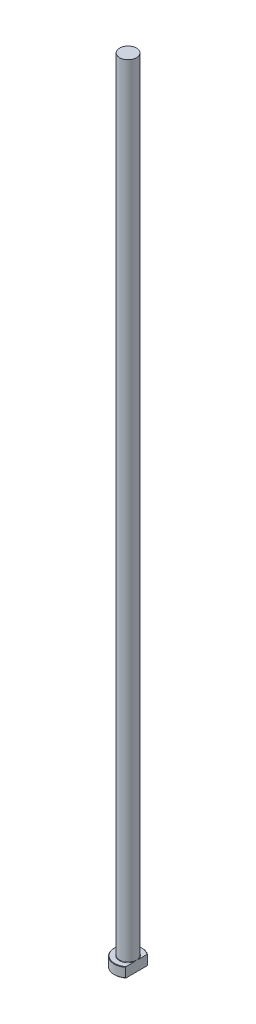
ISO-10303-21;
HEADER;
FILE_DESCRIPTION(('STEP AP214'),'2;1');
FILE_NAME('part.step','',(''),(''),'','','');
FILE_SCHEMA(('AUTOMOTIVE_DESIGN { 1 0 10303 214 1 1 1 1 }'));
ENDSEC;
DATA;
#1=APPLICATION_CONTEXT('core data for automotive mechanical design processes');
#2=APPLICATION_PROTOCOL_DEFINITION('international standard','automotive_design',2000,#1);
#3=PRODUCT_CONTEXT('',#1,'mechanical');
#4=PRODUCT('Part','Part','',(#3));
#5=PRODUCT_RELATED_PRODUCT_CATEGORY('part','',(#4));
#6=PRODUCT_DEFINITION_FORMATION('','',#4);
#7=PRODUCT_DEFINITION_CONTEXT('part definition',#1,'design');
#8=PRODUCT_DEFINITION('design','',#6,#7);
#9=PRODUCT_DEFINITION_SHAPE('','',#8);
#10=(LENGTH_UNIT() NAMED_UNIT(*) SI_UNIT(.MILLI.,.METRE.));
#11=(NAMED_UNIT(*) PLANE_ANGLE_UNIT() SI_UNIT($,.RADIAN.));
#12=(NAMED_UNIT(*) SI_UNIT($,.STERADIAN.) SOLID_ANGLE_UNIT());
#13=UNCERTAINTY_MEASURE_WITH_UNIT(LENGTH_MEASURE(1.E-05),#10,'distance_accuracy_value','');
#14=(GEOMETRIC_REPRESENTATION_CONTEXT(3) GLOBAL_UNCERTAINTY_ASSIGNED_CONTEXT((#13)) GLOBAL_UNIT_ASSIGNED_CONTEXT((#10,
#11,#12)) REPRESENTATION_CONTEXT('',''));
#15=CARTESIAN_POINT('',(0.,0.,0.));
#16=DIRECTION('',(0.,0.,1.));
#17=DIRECTION('',(1.,0.,0.));
#18=AXIS2_PLACEMENT_3D('',#15,#16,#17);
#19=CARTESIAN_POINT('',(0.,0.,0.));
#20=DIRECTION('',(0.,-1.,0.));
#21=DIRECTION('',(0.,0.,-1.));
#22=AXIS2_PLACEMENT_3D('',#19,#20,#21);
#23=PLANE('',#22);
#24=CARTESIAN_POINT('',(0.,0.,0.));
#25=DIRECTION('',(0.,-1.,0.));
#26=DIRECTION('',(0.,0.,-1.));
#27=AXIS2_PLACEMENT_3D('',#24,#25,#26);
#28=CIRCLE('',#27,6.79999999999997);
#29=CARTESIAN_POINT('',(4.24999999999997,0.,5.30824829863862));
#30=VERTEX_POINT('',#29);
#31=CARTESIAN_POINT('',(4.24999999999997,0.,-5.30824829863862));
#32=VERTEX_POINT('',#31);
#33=EDGE_CURVE('E98',#30,#32,#28,.T.);
#34=ORIENTED_EDGE('',*,*,#33,.T.);
#35=DIRECTION('',(0.,0.,1.));
#36=VECTOR('',#35,1.);
#37=CARTESIAN_POINT('',(4.24999999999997,0.,-5.56214886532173));
#38=LINE('',#37,#36);
#39=EDGE_CURVE('E83',#32,#30,#38,.T.);
#40=ORIENTED_EDGE('',*,*,#39,.T.);
#41=EDGE_LOOP('',(#34,#40));
#42=FACE_BOUND('',#41,.T.);
#43=ADVANCED_FACE('F32',(#42),#23,.T.);
#44=CARTESIAN_POINT('',(0.,259.958771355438,0.));
#45=DIRECTION('',(0.,1.,0.));
#46=DIRECTION('',(0.,0.,1.));
#47=AXIS2_PLACEMENT_3D('',#44,#45,#46);
#48=CYLINDRICAL_SURFACE('',#47,6.99999999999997);
#49=CARTESIAN_POINT('',(0.,4.80000000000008,0.));
#50=DIRECTION('',(0.,1.,0.));
#51=DIRECTION('',(0.,0.,1.));
#52=AXIS2_PLACEMENT_3D('',#49,#50,#51);
#53=CIRCLE('',#52,6.99999999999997);
#54=CARTESIAN_POINT('',(4.24999999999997,4.80000000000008,5.56214886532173));
#55=VERTEX_POINT('',#54);
#56=CARTESIAN_POINT('',(4.24999999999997,4.80000000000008,-5.56214886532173));
#57=VERTEX_POINT('',#56);
#58=EDGE_CURVE('E104',#55,#57,#53,.F.);
#59=ORIENTED_EDGE('',*,*,#58,.T.);
#60=DIRECTION('',(0.,-1.,0.));
#61=VECTOR('',#60,1.);
#62=CARTESIAN_POINT('',(4.24999999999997,400.,-5.56214886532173));
#63=LINE('',#62,#61);
#64=CARTESIAN_POINT('',(4.24999999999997,0.199999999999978,-5.56214886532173));
#65=VERTEX_POINT('',#64);
#66=EDGE_CURVE('E183',#57,#65,#63,.T.);
#67=ORIENTED_EDGE('',*,*,#66,.T.);
#68=CARTESIAN_POINT('',(0.,0.199999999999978,0.));
#69=DIRECTION('',(0.,-1.,0.));
#70=DIRECTION('',(0.,0.,-1.));
#71=AXIS2_PLACEMENT_3D('',#68,#69,#70);
#72=CIRCLE('',#71,6.99999999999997);
#73=CARTESIAN_POINT('',(4.24999999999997,0.199999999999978,5.56214886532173));
#74=VERTEX_POINT('',#73);
#75=EDGE_CURVE('E100',#65,#74,#72,.F.);
#76=ORIENTED_EDGE('',*,*,#75,.T.);
#77=DIRECTION('',(0.,-1.,0.));
#78=VECTOR('',#77,1.);
#79=CARTESIAN_POINT('',(4.24999999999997,400.,5.56214886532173));
#80=LINE('',#79,#78);
#81=EDGE_CURVE('E93',#55,#74,#80,.T.);
#82=ORIENTED_EDGE('',*,*,#81,.F.);
#83=EDGE_LOOP('',(#59,#67,#76,#82));
#84=FACE_BOUND('',#83,.T.);
#85=ADVANCED_FACE('F158',(#84),#48,.T.);
#86=CARTESIAN_POINT('',(-6.99999999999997,5.,0.));
#87=DIRECTION('',(0.,1.,0.));
#88=DIRECTION('',(0.,0.,1.));
#89=AXIS2_PLACEMENT_3D('',#86,#87,#88);
#90=PLANE('',#89);
#91=CARTESIAN_POINT('',(0.,5.,0.));
#92=DIRECTION('',(0.,1.,0.));
#93=DIRECTION('',(0.,0.,1.));
#94=AXIS2_PLACEMENT_3D('',#91,#92,#93);
#95=CIRCLE('',#94,6.80000000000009);
#96=CARTESIAN_POINT('',(4.24999999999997,5.,-5.30824829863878));
#97=VERTEX_POINT('',#96);
#98=CARTESIAN_POINT('',(4.24999999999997,5.,5.30824829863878));
#99=VERTEX_POINT('',#98);
#100=EDGE_CURVE('E178',#97,#99,#95,.T.);
#101=ORIENTED_EDGE('',*,*,#100,.T.);
#102=DIRECTION('',(0.,0.,-1.));
#103=VECTOR('',#102,1.);
#104=CARTESIAN_POINT('',(4.24999999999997,5.,0.));
#105=LINE('',#104,#103);
#106=CARTESIAN_POINT('',(4.24999999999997,4.99999999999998,1.31909059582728));
#107=VERTEX_POINT('',#106);
#108=EDGE_CURVE('E57',#99,#107,#105,.T.);
#109=ORIENTED_EDGE('',*,*,#108,.T.);
#110=CARTESIAN_POINT('',(0.,5.,0.));
#111=DIRECTION('',(0.,1.,0.));
#112=DIRECTION('',(0.,0.,1.));
#113=AXIS2_PLACEMENT_3D('',#110,#111,#112);
#114=CIRCLE('',#113,4.44999999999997);
#115=CARTESIAN_POINT('',(4.24999999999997,4.99999999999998,-1.31909059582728));
#116=VERTEX_POINT('',#115);
#117=EDGE_CURVE('E107',#107,#116,#114,.F.);
#118=ORIENTED_EDGE('',*,*,#117,.T.);
#119=EDGE_CURVE('E136',#116,#97,#105,.T.);
#120=ORIENTED_EDGE('',*,*,#119,.T.);
#121=EDGE_LOOP('',(#101,#109,#118,#120));
#122=FACE_BOUND('',#121,.T.);
#123=ADVANCED_FACE('F147',(#122),#90,.T.);
#124=CARTESIAN_POINT('',(0.,5.,0.));
#125=DIRECTION('',(0.,-1.,0.));
#126=DIRECTION('',(0.,0.,-1.));
#127=AXIS2_PLACEMENT_3D('',#124,#125,#126);
#128=CONICAL_SURFACE('',#127,6.80000000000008,0.785398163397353);
#129=ORIENTED_EDGE('',*,*,#58,.F.);
#130=CARTESIAN_POINT('',(4.24999999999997,-1.15497179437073,12.2380061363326));
#131=CARTESIAN_POINT('',(4.24999999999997,-0.968600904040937,12.0407126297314));
#132=CARTESIAN_POINT('',(4.24999999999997,-0.782481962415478,11.843180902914));
#133=CARTESIAN_POINT('',(4.24999999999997,-0.410835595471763,11.4475596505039));
#134=CARTESIAN_POINT('',(4.24999999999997,-0.225308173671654,11.2494701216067));
#135=CARTESIAN_POINT('',(4.24999999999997,0.330615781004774,10.6538566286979));
#136=CARTESIAN_POINT('',(4.24999999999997,0.699987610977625,10.2553749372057));
#137=CARTESIAN_POINT('',(4.24999999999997,1.44820689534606,9.44056382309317));
#138=CARTESIAN_POINT('',(4.24999999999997,1.82691721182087,9.0241080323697));
#139=CARTESIAN_POINT('',(4.24999999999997,2.39038838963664,8.39564122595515));
#140=CARTESIAN_POINT('',(4.24999999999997,2.57736390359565,8.18561642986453));
#141=CARTESIAN_POINT('',(4.24999999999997,2.94948531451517,7.76395344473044));
#142=CARTESIAN_POINT('',(4.24999999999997,3.13463122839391,7.55231527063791));
#143=CARTESIAN_POINT('',(4.24999999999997,3.5024381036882,7.12729701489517));
#144=CARTESIAN_POINT('',(4.24999999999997,3.6851015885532,6.91391912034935));
#145=CARTESIAN_POINT('',(4.24999999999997,4.04753998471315,6.4847025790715));
#146=CARTESIAN_POINT('',(4.24999999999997,4.22731476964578,6.26886382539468));
#147=CARTESIAN_POINT('',(4.24999999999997,4.58362310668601,5.83346482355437));
#148=CARTESIAN_POINT('',(4.24999999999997,4.76014565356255,5.61389554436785));
#149=CARTESIAN_POINT('',(4.24999999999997,5.10813954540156,5.17081545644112));
#150=CARTESIAN_POINT('',(4.24999999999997,5.27961153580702,4.94730515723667));
#151=CARTESIAN_POINT('',(4.24999999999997,5.61292794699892,4.4988347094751));
#152=CARTESIAN_POINT('',(4.24999999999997,5.77488381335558,4.27395773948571));
#153=CARTESIAN_POINT('',(4.24999999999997,6.0895903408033,3.81755429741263));
#154=CARTESIAN_POINT('',(4.24999999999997,6.24233528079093,3.58602382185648));
#155=CARTESIAN_POINT('',(4.24999999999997,6.46088242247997,3.23296927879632));
#156=CARTESIAN_POINT('',(4.24999999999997,6.53180994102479,3.11461948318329));
#157=CARTESIAN_POINT('',(4.24999999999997,6.66953191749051,2.87554671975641));
#158=CARTESIAN_POINT('',(4.24999999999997,6.7363269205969,2.75482406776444));
#159=CARTESIAN_POINT('',(4.24999999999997,6.86480050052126,2.51086229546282));
#160=CARTESIAN_POINT('',(4.24999999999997,6.92648531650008,2.38762647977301));
#161=CARTESIAN_POINT('',(4.24999999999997,7.04367856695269,2.13827051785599));
#162=CARTESIAN_POINT('',(4.24999999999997,7.09918867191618,2.01215116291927));
#163=CARTESIAN_POINT('',(4.24999999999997,7.20212054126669,1.75821381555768));
#164=CARTESIAN_POINT('',(4.24999999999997,7.24962333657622,1.63042897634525));
#165=CARTESIAN_POINT('',(4.24999999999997,7.33574687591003,1.37182854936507));
#166=CARTESIAN_POINT('',(4.24999999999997,7.37436534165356,1.24101219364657));
#167=CARTESIAN_POINT('',(4.24999999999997,7.44090399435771,0.977431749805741));
#168=CARTESIAN_POINT('',(4.24999999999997,7.46888314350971,0.844682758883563));
#169=CARTESIAN_POINT('',(4.24999999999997,7.51300819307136,0.577216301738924));
#170=CARTESIAN_POINT('',(4.24999999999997,7.52915548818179,0.442499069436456));
#171=CARTESIAN_POINT('',(4.24999999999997,7.54874331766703,0.170860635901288));
#172=CARTESIAN_POINT('',(4.24999999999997,7.55206380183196,0.0339306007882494));
#173=CARTESIAN_POINT('',(4.24999999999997,7.5454483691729,-0.239598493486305));
#174=CARTESIAN_POINT('',(4.24999999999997,7.53551276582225,-0.376197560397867));
#175=CARTESIAN_POINT('',(4.24999999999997,7.50295253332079,-0.648437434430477));
#176=CARTESIAN_POINT('',(4.24999999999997,7.48027427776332,-0.784071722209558));
#177=CARTESIAN_POINT('',(4.24999999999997,7.42348982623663,-1.05291460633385));
#178=CARTESIAN_POINT('',(4.24999999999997,7.38938084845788,-1.18612260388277));
#179=CARTESIAN_POINT('',(4.24999999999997,7.29188531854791,-1.51531404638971));
#180=CARTESIAN_POINT('',(4.24999999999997,7.22238075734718,-1.70947814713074));
#181=CARTESIAN_POINT('',(4.24999999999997,7.06668741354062,-2.0909759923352));
#182=CARTESIAN_POINT('',(4.24999999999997,6.98048657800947,-2.27830468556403));
#183=CARTESIAN_POINT('',(4.24999999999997,6.84149476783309,-2.5555275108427));
#184=CARTESIAN_POINT('',(4.24999999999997,6.79327931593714,-2.64776502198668));
#185=CARTESIAN_POINT('',(4.24999999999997,6.69413480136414,-2.83077431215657));
#186=CARTESIAN_POINT('',(4.24999999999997,6.64320570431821,-2.92154607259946));
#187=CARTESIAN_POINT('',(4.24999999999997,6.53904474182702,-3.1017010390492));
#188=CARTESIAN_POINT('',(4.24999999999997,6.48581387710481,-3.1910848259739));
#189=CARTESIAN_POINT('',(4.24999999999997,6.37734720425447,-3.36861867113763));
#190=CARTESIAN_POINT('',(4.24999999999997,6.32211148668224,-3.45676878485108));
#191=CARTESIAN_POINT('',(4.24999999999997,6.13027123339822,-3.75631659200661));
#192=CARTESIAN_POINT('',(4.24999999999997,5.98947006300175,-3.96503082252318));
#193=CARTESIAN_POINT('',(4.24999999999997,5.70061349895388,-4.37739745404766));
#194=CARTESIAN_POINT('',(4.24999999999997,5.55255625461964,-4.5810485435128));
#195=CARTESIAN_POINT('',(4.24999999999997,5.25096308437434,-4.9845103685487));
#196=CARTESIAN_POINT('',(4.24999999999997,5.09742258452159,-5.1843176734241));
#197=CARTESIAN_POINT('',(4.24999999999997,4.78630665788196,-5.58072220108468));
#198=CARTESIAN_POINT('',(4.24999999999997,4.62873161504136,-5.77731972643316));
#199=CARTESIAN_POINT('',(4.24999999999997,4.30987074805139,-6.16866624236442));
#200=CARTESIAN_POINT('',(4.24999999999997,4.14857352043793,-6.3634059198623));
#201=CARTESIAN_POINT('',(4.24999999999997,3.82349048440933,-6.75079948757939));
#202=CARTESIAN_POINT('',(4.24999999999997,3.6597046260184,-6.94345333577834));
#203=CARTESIAN_POINT('',(4.24999999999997,3.33022176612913,-7.32695469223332));
#204=CARTESIAN_POINT('',(4.24999999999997,3.16452573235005,-7.5178030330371));
#205=CARTESIAN_POINT('',(4.24999999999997,2.83151234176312,-7.89808083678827));
#206=CARTESIAN_POINT('',(4.24999999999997,2.66419497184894,-8.08751028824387));
#207=CARTESIAN_POINT('',(4.24999999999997,2.19674563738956,-8.61299836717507));
#208=CARTESIAN_POINT('',(4.24999999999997,1.89516668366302,-8.94776953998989));
#209=CARTESIAN_POINT('',(4.24999999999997,1.28890266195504,-9.61456394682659));
#210=CARTESIAN_POINT('',(4.24999999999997,0.984217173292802,-9.94658679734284));
#211=CARTESIAN_POINT('',(4.24999999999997,0.374739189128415,-10.6061264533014));
#212=CARTESIAN_POINT('',(4.24999999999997,0.0699631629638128,-10.9336584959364));
#213=CARTESIAN_POINT('',(4.24999999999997,-0.541317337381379,-11.5870007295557));
#214=CARTESIAN_POINT('',(4.24999999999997,-0.847821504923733,-11.9128112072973));
#215=CARTESIAN_POINT('',(4.24999999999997,-1.15497179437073,-12.2380061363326));
#216=B_SPLINE_CURVE_WITH_KNOTS('',3,(#130,#131,#132,#133,#134,#135,#136,#137,#138,#139,#140,
#141,#142,#143,#144,#145,#146,#147,#148,#149,#150,#151,#152,#153,#154,#155,#156,#157,#158,#159,
#160,#161,#162,#163,#164,#165,#166,#167,#168,#169,#170,#171,#172,#173,#174,#175,#176,#177,#178,
#179,#180,#181,#182,#183,#184,#185,#186,#187,#188,#189,#190,#191,#192,#193,#194,#195,#196,#197,
#198,#199,#200,#201,#202,#203,#204,#205,#206,#207,#208,#209,#210,#211,#212,#213,#214,#215),
.UNSPECIFIED.,.F.,.F.,(4,2,2,2,2,2,2,2,2,2,2,2,2,2,2,2,2,2,2,2,2,2,2,2,2,2,2,2,2,2,2,2,2,2,2,2,
2,2,2,2,2,2,4),(0.,0.814204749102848,1.62841433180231,3.25843263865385,4.94708916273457,
5.79066412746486,6.63423128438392,7.47686481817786,8.31953511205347,9.16466757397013,
10.0096915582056,10.8409260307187,11.6726715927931,12.0865355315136,12.5003447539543,
12.9136410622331,13.3268252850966,13.735538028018,14.1443554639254,14.5508730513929,
14.9573427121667,15.3676075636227,15.7778627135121,16.1898574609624,16.6019525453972,
17.2195383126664,17.837571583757,18.149773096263,18.4619785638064,18.7740496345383,
19.08610662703,19.8411596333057,20.5964062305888,21.3522982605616,22.1081186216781,
22.8666854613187,23.6252675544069,24.3834808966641,25.1417003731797,26.4934084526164,
27.8453020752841,29.1874909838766,30.5294487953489),.UNSPECIFIED.);
#217=EDGE_CURVE('E135',#55,#99,#216,.T.);
#218=ORIENTED_EDGE('',*,*,#217,.T.);
#219=ORIENTED_EDGE('',*,*,#100,.F.);
#220=EDGE_CURVE('E127',#97,#57,#216,.T.);
#221=ORIENTED_EDGE('',*,*,#220,.T.);
#222=EDGE_LOOP('',(#129,#218,#219,#221));
#223=FACE_BOUND('',#222,.T.);
#224=ADVANCED_FACE('F143',(#223),#128,.T.);
#225=CARTESIAN_POINT('',(0.,0.199999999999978,0.));
#226=DIRECTION('',(0.,1.,0.));
#227=DIRECTION('',(0.,0.,1.));
#228=AXIS2_PLACEMENT_3D('',#225,#226,#227);
#229=CONICAL_SURFACE('',#228,6.99999999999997,0.785398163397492);
#230=ORIENTED_EDGE('',*,*,#75,.F.);
#231=CARTESIAN_POINT('',(4.24999999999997,6.15497179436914,-12.2380061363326));
#232=CARTESIAN_POINT('',(4.24999999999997,5.96860090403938,-12.0407126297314));
#233=CARTESIAN_POINT('',(4.24999999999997,5.78248196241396,-11.843180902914));
#234=CARTESIAN_POINT('',(4.24999999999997,5.41083559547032,-11.4475596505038));
#235=CARTESIAN_POINT('',(4.24999999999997,5.22530817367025,-11.2494701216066));
#236=CARTESIAN_POINT('',(4.24999999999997,4.66938421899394,-10.6538566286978));
#237=CARTESIAN_POINT('',(4.24999999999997,4.30001238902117,-10.2553749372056));
#238=CARTESIAN_POINT('',(4.24999999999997,3.55179310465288,-9.44056382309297));
#239=CARTESIAN_POINT('',(4.24999999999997,3.17308278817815,-9.02410803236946));
#240=CARTESIAN_POINT('',(4.24999999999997,2.60961161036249,-8.39564122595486));
#241=CARTESIAN_POINT('',(4.24999999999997,2.42263609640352,-8.18561642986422));
#242=CARTESIAN_POINT('',(4.24999999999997,2.05051468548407,-7.76395344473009));
#243=CARTESIAN_POINT('',(4.24999999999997,1.86536877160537,-7.55231527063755));
#244=CARTESIAN_POINT('',(4.24999999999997,1.49756189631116,-7.12729701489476));
#245=CARTESIAN_POINT('',(4.24999999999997,1.31489841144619,-6.91391912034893));
#246=CARTESIAN_POINT('',(4.24999999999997,0.952460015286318,-6.48470257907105));
#247=CARTESIAN_POINT('',(4.24999999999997,0.772685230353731,-6.26886382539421));
#248=CARTESIAN_POINT('',(4.24999999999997,0.416376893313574,-5.83346482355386));
#249=CARTESIAN_POINT('',(4.24999999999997,0.239854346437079,-5.61389554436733));
#250=CARTESIAN_POINT('',(4.24999999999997,-0.108139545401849,-5.17081545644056));
#251=CARTESIAN_POINT('',(4.24999999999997,-0.279611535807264,-4.94730515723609));
#252=CARTESIAN_POINT('',(4.24999999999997,-0.612927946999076,-4.49883470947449));
#253=CARTESIAN_POINT('',(4.24999999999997,-0.774883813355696,-4.27395773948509));
#254=CARTESIAN_POINT('',(4.24999999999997,-1.08959034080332,-3.81755429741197));
#255=CARTESIAN_POINT('',(4.24999999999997,-1.24233528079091,-3.58602382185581));
#256=CARTESIAN_POINT('',(4.24999999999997,-1.46088242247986,-3.23296927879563));
#257=CARTESIAN_POINT('',(4.24999999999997,-1.53180994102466,-3.1146194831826));
#258=CARTESIAN_POINT('',(4.24999999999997,-1.66953191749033,-2.8755467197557));
#259=CARTESIAN_POINT('',(4.24999999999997,-1.73632692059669,-2.75482406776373));
#260=CARTESIAN_POINT('',(4.24999999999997,-1.864800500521,-2.51086229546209));
#261=CARTESIAN_POINT('',(4.24999999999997,-1.92648531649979,-2.38762647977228));
#262=CARTESIAN_POINT('',(4.24999999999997,-2.04367856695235,-2.13827051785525));
#263=CARTESIAN_POINT('',(4.24999999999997,-2.09918867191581,-2.01215116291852));
#264=CARTESIAN_POINT('',(4.24999999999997,-2.20212054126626,-1.75821381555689));
#265=CARTESIAN_POINT('',(4.24999999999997,-2.24962333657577,-1.63042897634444));
#266=CARTESIAN_POINT('',(4.24999999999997,-2.33574687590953,-1.3718285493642));
#267=CARTESIAN_POINT('',(4.24999999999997,-2.37436534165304,-1.24101219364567));
#268=CARTESIAN_POINT('',(4.24999999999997,-2.44090399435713,-0.977431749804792));
#269=CARTESIAN_POINT('',(4.24999999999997,-2.4688831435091,-0.844682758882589));
#270=CARTESIAN_POINT('',(4.24999999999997,-2.51300819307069,-0.577216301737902));
#271=CARTESIAN_POINT('',(4.24999999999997,-2.52915548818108,-0.442499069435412));
#272=CARTESIAN_POINT('',(4.24999999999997,-2.54874331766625,-0.170860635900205));
#273=CARTESIAN_POINT('',(4.24999999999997,-2.55206380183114,-0.0339306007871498));
#274=CARTESIAN_POINT('',(4.24999999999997,-2.54544836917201,0.239598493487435));
#275=CARTESIAN_POINT('',(4.24999999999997,-2.53551276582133,0.37619756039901));
#276=CARTESIAN_POINT('',(4.24999999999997,-2.5029525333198,0.648437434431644));
#277=CARTESIAN_POINT('',(4.24999999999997,-2.4802742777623,0.784071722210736));
#278=CARTESIAN_POINT('',(4.24999999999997,-2.42348982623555,1.05291460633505));
#279=CARTESIAN_POINT('',(4.24999999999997,-2.38938084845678,1.18612260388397));
#280=CARTESIAN_POINT('',(4.24999999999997,-2.2918853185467,1.51531404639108));
#281=CARTESIAN_POINT('',(4.24999999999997,-2.22238075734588,1.70947814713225));
#282=CARTESIAN_POINT('',(4.24999999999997,-2.06668741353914,2.090975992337));
#283=CARTESIAN_POINT('',(4.24999999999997,-1.98048657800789,2.27830468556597));
#284=CARTESIAN_POINT('',(4.24999999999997,-1.84149476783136,2.55552751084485));
#285=CARTESIAN_POINT('',(4.24999999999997,-1.79327931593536,2.64776502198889));
#286=CARTESIAN_POINT('',(4.24999999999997,-1.69413480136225,2.83077431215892));
#287=CARTESIAN_POINT('',(4.24999999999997,-1.64320570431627,2.92154607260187));
#288=CARTESIAN_POINT('',(4.24999999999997,-1.53904474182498,3.10170103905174));
#289=CARTESIAN_POINT('',(4.24999999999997,-1.48581387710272,3.19108482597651));
#290=CARTESIAN_POINT('',(4.24999999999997,-1.37734720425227,3.36861867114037));
#291=CARTESIAN_POINT('',(4.24999999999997,-1.32211148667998,3.45676878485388));
#292=CARTESIAN_POINT('',(4.24999999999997,-1.13027123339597,3.75631659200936));
#293=CARTESIAN_POINT('',(4.24999999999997,-0.989470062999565,3.96503082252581));
#294=CARTESIAN_POINT('',(4.24999999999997,-0.700613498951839,4.37739745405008));
#295=CARTESIAN_POINT('',(4.24999999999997,-0.552556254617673,4.58104854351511));
#296=CARTESIAN_POINT('',(4.24999999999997,-0.250963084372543,4.98451036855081));
#297=CARTESIAN_POINT('',(4.24999999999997,-0.0974225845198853,5.18431767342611));
#298=CARTESIAN_POINT('',(4.24999999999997,0.213693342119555,5.5807222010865));
#299=CARTESIAN_POINT('',(4.24999999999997,0.371268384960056,5.7773197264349));
#300=CARTESIAN_POINT('',(4.24999999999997,0.69012925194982,6.16866624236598));
#301=CARTESIAN_POINT('',(4.24999999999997,0.851426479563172,6.36340591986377));
#302=CARTESIAN_POINT('',(4.24999999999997,1.17650951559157,6.75079948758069));
#303=CARTESIAN_POINT('',(4.24999999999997,1.34029537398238,6.94345333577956));
#304=CARTESIAN_POINT('',(4.24999999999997,1.66977823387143,7.32695469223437));
#305=CARTESIAN_POINT('',(4.24999999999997,1.8354742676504,7.51780303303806));
#306=CARTESIAN_POINT('',(4.24999999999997,2.16848765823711,7.89808083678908));
#307=CARTESIAN_POINT('',(4.24999999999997,2.33580502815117,8.0875102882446));
#308=CARTESIAN_POINT('',(4.24999999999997,2.8032543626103,8.61299836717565));
#309=CARTESIAN_POINT('',(4.24999999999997,3.10483331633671,8.94776953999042));
#310=CARTESIAN_POINT('',(4.24999999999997,3.71109733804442,9.61456394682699));
#311=CARTESIAN_POINT('',(4.24999999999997,4.01578282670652,9.94658679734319));
#312=CARTESIAN_POINT('',(4.24999999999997,4.62526081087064,10.6061264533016));
#313=CARTESIAN_POINT('',(4.24999999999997,4.93003683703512,10.9336584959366));
#314=CARTESIAN_POINT('',(4.24999999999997,5.54131733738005,11.5870007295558));
#315=CARTESIAN_POINT('',(4.24999999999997,5.84782150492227,11.9128112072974));
#316=CARTESIAN_POINT('',(4.24999999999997,6.15497179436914,12.2380061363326));
#317=B_SPLINE_CURVE_WITH_KNOTS('',3,(#231,#232,#233,#234,#235,#236,#237,#238,#239,#240,#241,
#242,#243,#244,#245,#246,#247,#248,#249,#250,#251,#252,#253,#254,#255,#256,#257,#258,#259,#260,
#261,#262,#263,#264,#265,#266,#267,#268,#269,#270,#271,#272,#273,#274,#275,#276,#277,#278,#279,
#280,#281,#282,#283,#284,#285,#286,#287,#288,#289,#290,#291,#292,#293,#294,#295,#296,#297,#298,
#299,#300,#301,#302,#303,#304,#305,#306,#307,#308,#309,#310,#311,#312,#313,#314,#315,#316),
.UNSPECIFIED.,.F.,.F.,(4,2,2,2,2,2,2,2,2,2,2,2,2,2,2,2,2,2,2,2,2,2,2,2,2,2,2,2,2,2,2,2,2,2,2,2,
2,2,2,2,2,2,4),(0.,0.814204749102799,1.62841433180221,3.25843263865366,4.94708916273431,
5.79066412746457,6.63423128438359,7.4768648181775,8.31953511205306,9.1646675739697,
10.0096915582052,10.8409260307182,11.6726715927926,12.0865355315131,12.5003447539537,
12.9136410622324,13.326825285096,13.7355380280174,14.1443554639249,14.5508730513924,
14.9573427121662,15.3676075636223,15.7778627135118,16.1898574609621,16.601952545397,
17.2195383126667,17.8375715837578,18.149773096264,18.4619785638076,18.7740496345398,
19.0861066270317,19.8411596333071,20.5964062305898,21.3522982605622,22.1081186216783,
22.8666854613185,23.6252675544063,24.3834808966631,25.1417003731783,26.4934084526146,
27.8453020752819,29.187490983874,30.529448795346),.UNSPECIFIED.);
#318=EDGE_CURVE('E86',#65,#32,#317,.T.);
#319=ORIENTED_EDGE('',*,*,#318,.T.);
#320=ORIENTED_EDGE('',*,*,#33,.F.);
#321=EDGE_CURVE('E89',#30,#74,#317,.T.);
#322=ORIENTED_EDGE('',*,*,#321,.T.);
#323=EDGE_LOOP('',(#230,#319,#320,#322));
#324=FACE_BOUND('',#323,.T.);
#325=ADVANCED_FACE('F97',(#324),#229,.T.);
#326=CARTESIAN_POINT('',(0.,5.19999999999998,0.));
#327=DIRECTION('',(0.,1.,0.));
#328=DIRECTION('',(0.,0.,1.));
#329=AXIS2_PLACEMENT_3D('',#326,#327,#328);
#330=TOROIDAL_SURFACE('',#329,4.44999999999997,0.2);
#331=CARTESIAN_POINT('',(4.24999999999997,5.19999999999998,0.));
#332=CARTESIAN_POINT('',(4.24999999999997,5.20000051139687,1.15744821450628E-10));
#333=CARTESIAN_POINT('',(4.24999999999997,5.20000102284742,-2.4293169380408E-07));
#334=CARTESIAN_POINT('',(4.24999999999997,5.20000197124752,-8.87321860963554E-07));
#335=CARTESIAN_POINT('',(4.24999999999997,5.20000238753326,-1.30614850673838E-06));
#336=CARTESIAN_POINT('',(4.24999999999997,5.20000327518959,-2.31752643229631E-06));
#337=CARTESIAN_POINT('',(4.24999999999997,5.20000373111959,-2.92646131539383E-06));
#338=CARTESIAN_POINT('',(4.24999999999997,5.200004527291,-4.16981951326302E-06));
#339=CARTESIAN_POINT('',(4.24999999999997,5.2000048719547,-4.80170872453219E-06));
#340=CARTESIAN_POINT('',(4.24999999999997,5.20000620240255,-7.3194814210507E-06));
#341=CARTESIAN_POINT('',(4.24999999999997,5.20000712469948,-9.24257745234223E-06));
#342=CARTESIAN_POINT('',(4.24999999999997,5.20000859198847,-1.29952261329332E-05));
#343=CARTESIAN_POINT('',(4.24999999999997,5.20000916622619,-1.48137375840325E-05));
#344=CARTESIAN_POINT('',(4.24999999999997,5.20001166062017,-2.2701068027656E-05));
#345=CARTESIAN_POINT('',(4.24999999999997,5.20001358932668,-2.87689532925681E-05));
#346=CARTESIAN_POINT('',(4.24999999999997,5.20001634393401,-4.00958698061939E-05));
#347=CARTESIAN_POINT('',(4.24999999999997,5.20001729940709,-4.53228601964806E-05));
#348=CARTESIAN_POINT('',(4.24999999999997,5.20002438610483,-8.47086375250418E-05));
#349=CARTESIAN_POINT('',(4.24999999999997,5.20002990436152,-0.000118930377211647));
#350=CARTESIAN_POINT('',(4.24999999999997,5.20005405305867,-0.000255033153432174));
#351=CARTESIAN_POINT('',(4.24999999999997,5.20007694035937,-0.00035616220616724));
#352=CARTESIAN_POINT('',(4.24999999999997,5.20016675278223,-0.000759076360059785));
#353=CARTESIAN_POINT('',(4.24999999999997,5.20023104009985,-0.00106124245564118));
#354=CARTESIAN_POINT('',(4.24999999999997,5.20048990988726,-0.00226975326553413));
#355=CARTESIAN_POINT('',(4.24999999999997,5.20068789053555,-0.00317558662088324));
#356=CARTESIAN_POINT('',(4.24999999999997,5.20151472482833,-0.00696787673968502));
#357=CARTESIAN_POINT('',(4.24999999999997,5.2021393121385,-0.00985497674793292));
#358=CARTESIAN_POINT('',(4.24999999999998,5.21047485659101,-0.0483744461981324));
#359=CARTESIAN_POINT('',(4.24999999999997,5.21821166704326,-0.0840032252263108));
#360=CARTESIAN_POINT('',(4.24999999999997,5.23443934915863,-0.15925743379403));
#361=CARTESIAN_POINT('',(4.24999999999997,5.24291807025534,-0.198885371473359));
#362=CARTESIAN_POINT('',(4.24999999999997,5.25719269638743,-0.266483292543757));
#363=CARTESIAN_POINT('',(4.24999999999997,5.2630418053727,-0.294441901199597));
#364=CARTESIAN_POINT('',(4.24999999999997,5.27443459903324,-0.349631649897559));
#365=CARTESIAN_POINT('',(4.24999999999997,5.27998226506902,-0.37686197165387));
#366=CARTESIAN_POINT('',(4.24999999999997,5.29789349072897,-0.466265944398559));
#367=CARTESIAN_POINT('',(4.24999999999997,5.3098841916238,-0.528515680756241));
#368=CARTESIAN_POINT('',(4.24999999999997,5.33255488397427,-0.653873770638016));
#369=CARTESIAN_POINT('',(4.24999999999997,5.34322118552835,-0.716984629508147));
#370=CARTESIAN_POINT('',(4.24999999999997,5.36341886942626,-0.849542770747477));
#371=CARTESIAN_POINT('',(4.24999999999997,5.37274606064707,-0.919022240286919));
#372=CARTESIAN_POINT('',(4.24999999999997,5.38787342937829,-1.05816998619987));
#373=CARTESIAN_POINT('',(4.24999999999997,5.39368393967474,-1.12783709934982));
#374=CARTESIAN_POINT('',(4.24999999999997,5.40022105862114,-1.26519903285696));
#375=CARTESIAN_POINT('',(4.24999999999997,5.40110718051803,-1.33288413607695));
#376=CARTESIAN_POINT('',(4.24999999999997,5.39715260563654,-1.43372383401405));
#377=CARTESIAN_POINT('',(4.24999999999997,5.39498924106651,-1.46697561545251));
#378=CARTESIAN_POINT('',(4.24999999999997,5.38843757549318,-1.53323057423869));
#379=CARTESIAN_POINT('',(4.24999999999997,5.38405165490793,-1.56623397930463));
#380=CARTESIAN_POINT('',(4.24999999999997,5.37221191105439,-1.63225744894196));
#381=CARTESIAN_POINT('',(4.24999999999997,5.36471302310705,-1.665270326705));
#382=CARTESIAN_POINT('',(4.24999999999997,5.35002141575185,-1.71373529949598));
#383=CARTESIAN_POINT('',(4.24999999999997,5.3445543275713,-1.72970598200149));
#384=CARTESIAN_POINT('',(4.24999999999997,5.33212858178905,-1.76104662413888));
#385=CARTESIAN_POINT('',(4.24999999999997,5.32517291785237,-1.77641771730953));
#386=CARTESIAN_POINT('',(4.24999999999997,5.31157493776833,-1.80173413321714));
#387=CARTESIAN_POINT('',(4.24999999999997,5.30543892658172,-1.81194868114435));
#388=CARTESIAN_POINT('',(4.24999999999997,5.29187259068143,-1.83147712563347));
#389=CARTESIAN_POINT('',(4.24999999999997,5.28444659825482,-1.84079387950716));
#390=CARTESIAN_POINT('',(4.24999999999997,5.27165788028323,-1.8539962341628));
#391=CARTESIAN_POINT('',(4.24999999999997,5.26687308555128,-1.85843752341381));
#392=CARTESIAN_POINT('',(4.24999999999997,5.25674280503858,-1.86663816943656));
#393=CARTESIAN_POINT('',(4.24999999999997,5.25139780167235,-1.87039810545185));
#394=CARTESIAN_POINT('',(4.24999999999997,5.24121545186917,-1.87633128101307));
#395=CARTESIAN_POINT('',(4.24999999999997,5.23647607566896,-1.87867040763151));
#396=CARTESIAN_POINT('',(4.24999999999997,5.22667692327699,-1.88254109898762));
#397=CARTESIAN_POINT('',(4.24999999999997,5.22161755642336,-1.88407367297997));
#398=CARTESIAN_POINT('',(4.24999999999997,5.21125115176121,-1.88618376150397));
#399=CARTESIAN_POINT('',(4.24999999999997,5.20594232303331,-1.8867527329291));
#400=CARTESIAN_POINT('',(4.24999999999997,5.1953165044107,-1.88683483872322));
#401=CARTESIAN_POINT('',(4.24999999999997,5.18999951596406,-1.88634814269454));
#402=CARTESIAN_POINT('',(4.24999999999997,5.18024254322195,-1.88451305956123));
#403=CARTESIAN_POINT('',(4.24999999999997,5.17577879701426,-1.88328567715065));
#404=CARTESIAN_POINT('',(4.24999999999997,5.16708370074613,-1.88018632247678));
#405=CARTESIAN_POINT('',(4.24999999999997,5.16285244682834,-1.87831408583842));
#406=CARTESIAN_POINT('',(4.24999999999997,5.15236530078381,-1.8728422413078));
#407=CARTESIAN_POINT('',(4.24999999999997,5.14630821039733,-1.86886321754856));
#408=CARTESIAN_POINT('',(4.24999999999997,5.13488065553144,-1.8600173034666));
#409=CARTESIAN_POINT('',(4.24999999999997,5.12951236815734,-1.85514771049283));
#410=CARTESIAN_POINT('',(4.24999999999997,5.11550691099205,-1.84083719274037));
#411=CARTESIAN_POINT('',(4.24999999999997,5.10752788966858,-1.83075903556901));
#412=CARTESIAN_POINT('',(4.24999999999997,5.09305704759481,-1.80961650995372));
#413=CARTESIAN_POINT('',(4.24999999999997,5.08656786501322,-1.7985504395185));
#414=CARTESIAN_POINT('',(4.24999999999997,5.07270261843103,-1.77195183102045));
#415=CARTESIAN_POINT('',(4.24999999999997,5.06578110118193,-1.75618509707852));
#416=CARTESIAN_POINT('',(4.24999999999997,5.05343494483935,-1.72406513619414));
#417=CARTESIAN_POINT('',(4.24999999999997,5.04801326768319,-1.70771081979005));
#418=CARTESIAN_POINT('',(4.24999999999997,5.03828568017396,-1.67446840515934));
#419=CARTESIAN_POINT('',(4.24999999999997,5.03399373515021,-1.65757628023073));
#420=CARTESIAN_POINT('',(4.24999999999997,5.02638165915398,-1.62359857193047));
#421=CARTESIAN_POINT('',(4.24999999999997,5.02306049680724,-1.60651321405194));
#422=CARTESIAN_POINT('',(4.24999999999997,5.01554103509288,-1.56237813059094));
#423=CARTESIAN_POINT('',(4.24999999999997,5.01193061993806,-1.53522860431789));
#424=CARTESIAN_POINT('',(4.24999999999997,5.00624732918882,-1.48076491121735));
#425=CARTESIAN_POINT('',(4.24999999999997,5.00417529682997,-1.45345066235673));
#426=CARTESIAN_POINT('',(4.24999999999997,4.99980704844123,-1.37123328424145));
#427=CARTESIAN_POINT('',(4.24999999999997,4.99938405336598,-1.31623108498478));
#428=CARTESIAN_POINT('',(4.24999999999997,5.00195512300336,-1.20937484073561));
#429=CARTESIAN_POINT('',(4.24999999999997,5.00476235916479,-1.15751417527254));
#430=CARTESIAN_POINT('',(4.24999999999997,5.01274020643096,-1.05395255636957));
#431=CARTESIAN_POINT('',(4.24999999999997,5.0179120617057,-1.00225170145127));
#432=CARTESIAN_POINT('',(4.24999999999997,5.0318667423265,-0.883772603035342));
#433=CARTESIAN_POINT('',(4.24999999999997,5.04126554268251,-0.817068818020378));
#434=CARTESIAN_POINT('',(4.24999999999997,5.06248695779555,-0.68230638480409));
#435=CARTESIAN_POINT('',(4.24999999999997,5.0743654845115,-0.614256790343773));
#436=CARTESIAN_POINT('',(4.24999999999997,5.09582131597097,-0.499048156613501));
#437=CARTESIAN_POINT('',(4.24999999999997,5.10500357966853,-0.451814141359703));
#438=CARTESIAN_POINT('',(4.24999999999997,5.1237965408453,-0.357991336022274));
#439=CARTESIAN_POINT('',(4.24999999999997,5.13340116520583,-0.311401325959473));
#440=CARTESIAN_POINT('',(4.24999999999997,5.15180561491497,-0.223687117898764));
#441=CARTESIAN_POINT('',(4.24999999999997,5.16056968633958,-0.182555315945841));
#442=CARTESIAN_POINT('',(4.24999999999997,5.178640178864,-0.0985301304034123));
#443=CARTESIAN_POINT('',(4.24999999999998,5.18795357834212,-0.0556381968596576));
#444=CARTESIAN_POINT('',(4.24999999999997,5.1978622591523,-0.00984762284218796));
#445=CARTESIAN_POINT('',(4.24999999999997,5.19848844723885,-0.00695317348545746));
#446=CARTESIAN_POINT('',(4.24999999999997,5.1993156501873,-0.00315924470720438));
#447=CARTESIAN_POINT('',(4.24999999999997,5.19951238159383,-0.00225911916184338));
#448=CARTESIAN_POINT('',(4.24999999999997,5.19976973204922,-0.00105770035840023));
#449=CARTESIAN_POINT('',(4.24999999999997,5.19983372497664,-0.000756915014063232));
#450=CARTESIAN_POINT('',(4.24999999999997,5.19992318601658,-0.000355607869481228));
#451=CARTESIAN_POINT('',(4.24999999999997,5.19994602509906,-0.000254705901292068));
#452=CARTESIAN_POINT('',(4.24999999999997,5.1999701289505,-0.000118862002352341));
#453=CARTESIAN_POINT('',(4.24999999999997,5.19997564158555,-8.4670569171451E-05));
#454=CARTESIAN_POINT('',(4.24999999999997,5.19998271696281,-4.53159337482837E-05));
#455=CARTESIAN_POINT('',(4.24999999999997,5.19998367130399,-4.00904844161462E-05));
#456=CARTESIAN_POINT('',(4.24999999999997,5.19998642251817,-2.87668536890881E-05));
#457=CARTESIAN_POINT('',(4.24999999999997,5.19998834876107,-2.27006335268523E-05));
#458=CARTESIAN_POINT('',(4.24999999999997,5.19999084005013,-1.48150638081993E-05));
#459=CARTESIAN_POINT('',(4.24999999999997,5.199991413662,-1.29966656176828E-05));
#460=CARTESIAN_POINT('',(4.24999999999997,5.19999287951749,-9.24415318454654E-06));
#461=CARTESIAN_POINT('',(4.24999999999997,5.19999380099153,-7.32106390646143E-06));
#462=CARTESIAN_POINT('',(4.24999999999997,5.19999513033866,-4.8031966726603E-06));
#463=CARTESIAN_POINT('',(4.24999999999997,5.19999547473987,-4.17124743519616E-06));
#464=CARTESIAN_POINT('',(4.24999999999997,5.19999627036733,-2.92772184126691E-06));
#465=CARTESIAN_POINT('',(4.24999999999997,5.19999672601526,-2.31867707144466E-06));
#466=CARTESIAN_POINT('',(4.24999999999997,5.19999761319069,-1.30704757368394E-06));
#467=CARTESIAN_POINT('',(4.24999999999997,5.19999802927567,-8.88090030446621E-07));
#468=CARTESIAN_POINT('',(4.24999999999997,5.19999897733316,-2.43359811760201E-07));
#469=CARTESIAN_POINT('',(4.24999999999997,5.19999948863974,-1.15736528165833E-10));
#470=CARTESIAN_POINT('',(4.24999999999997,5.19999999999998,0.));
#471=B_SPLINE_CURVE_WITH_KNOTS('',3,(#331,#332,#333,#334,#335,#336,#337,#338,#339,#340,#341,
#342,#343,#344,#345,#346,#347,#348,#349,#350,#351,#352,#353,#354,#355,#356,#357,#358,#359,#360,
#361,#362,#363,#364,#365,#366,#367,#368,#369,#370,#371,#372,#373,#374,#375,#376,#377,#378,#379,
#380,#381,#382,#383,#384,#385,#386,#387,#388,#389,#390,#391,#392,#393,#394,#395,#396,#397,#398,
#399,#400,#401,#402,#403,#404,#405,#406,#407,#408,#409,#410,#411,#412,#413,#414,#415,#416,#417,
#418,#419,#420,#421,#422,#423,#424,#425,#426,#427,#428,#429,#430,#431,#432,#433,#434,#435,#436,
#437,#438,#439,#440,#441,#442,#443,#444,#445,#446,#447,#448,#449,#450,#451,#452,#453,#454,#455,
#456,#457,#458,#459,#460,#461,#462,#463,#464,#465,#466,#467,#468,#469,#470),.UNSPECIFIED.,.T.,
.F.,(4,2,2,2,2,2,2,2,2,2,2,2,2,2,2,2,2,2,2,2,2,2,2,2,2,2,2,2,2,2,2,2,2,2,2,2,2,2,2,2,2,2,2,2,2,
2,2,2,2,2,2,2,2,2,2,2,2,2,2,2,2,2,2,2,2,2,2,2,2,4),(0.,1.56348638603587E-06,
3.34736003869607E-06,5.61252474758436E-06,7.7714730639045E-06,1.41498338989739E-05,
1.98654803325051E-05,3.89412506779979E-05,5.48646730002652E-05,0.000158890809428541,
0.000469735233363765,0.00139675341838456,0.00417812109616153,0.0130401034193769,
0.122414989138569,0.243989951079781,0.329681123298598,0.413050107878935,0.603220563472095,
0.795216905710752,1.00545960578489,1.21508152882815,1.41787186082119,1.51777979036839,
1.61758094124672,1.71888023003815,1.76947366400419,1.81996629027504,1.85565144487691,
1.89121899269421,1.91076085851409,1.93028603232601,1.94608264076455,1.9618594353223,
1.97777538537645,1.99368877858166,2.00752120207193,2.02135930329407,2.04297559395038,
2.06465860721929,2.10300421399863,2.14141720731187,2.19295510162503,2.24459405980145,
2.29684419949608,2.34903862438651,2.43114134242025,2.51328903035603,2.67811431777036,
2.83386590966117,2.98969954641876,3.19173551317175,3.39894587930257,3.54329728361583,
3.68600406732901,3.81216982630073,3.94384090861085,3.95272545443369,3.9554892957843,
3.9564120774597,3.95672222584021,3.95682615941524,3.95684207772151,3.95686114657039,
3.95686686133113,3.9568732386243,3.95687539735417,3.95687766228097,3.95687944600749,
3.95688100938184),.UNSPECIFIED.);
#472=CARTESIAN_POINT('',(4.24999999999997,5.19999999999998,0.));
#473=VERTEX_POINT('',#472);
#474=EDGE_CURVE('E11',#116,#473,#471,.T.);
#475=ORIENTED_EDGE('',*,*,#474,.F.);
#476=ORIENTED_EDGE('',*,*,#117,.F.);
#477=CARTESIAN_POINT('',(4.24999999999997,5.19999999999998,0.));
#478=CARTESIAN_POINT('',(4.24999999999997,5.1999994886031,-1.15744598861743E-10));
#479=CARTESIAN_POINT('',(4.24999999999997,5.19999897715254,2.42931693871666E-07));
#480=CARTESIAN_POINT('',(4.24999999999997,5.19999802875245,8.87321860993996E-07));
#481=CARTESIAN_POINT('',(4.24999999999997,5.1999976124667,1.30614850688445E-06));
#482=CARTESIAN_POINT('',(4.24999999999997,5.19999672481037,2.31752643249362E-06));
#483=CARTESIAN_POINT('',(4.24999999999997,5.19999626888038,2.92646131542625E-06));
#484=CARTESIAN_POINT('',(4.24999999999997,5.19999547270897,4.16981951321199E-06));
#485=CARTESIAN_POINT('',(4.24999999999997,5.19999512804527,4.8017087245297E-06));
#486=CARTESIAN_POINT('',(4.24999999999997,5.19999379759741,7.31948142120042E-06));
#487=CARTESIAN_POINT('',(4.24999999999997,5.19999287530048,9.24257745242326E-06));
#488=CARTESIAN_POINT('',(4.24999999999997,5.1999914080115,1.29952261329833E-05));
#489=CARTESIAN_POINT('',(4.24999999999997,5.19999083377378,1.48137375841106E-05));
#490=CARTESIAN_POINT('',(4.24999999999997,5.19998833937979,2.27010680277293E-05));
#491=CARTESIAN_POINT('',(4.24999999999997,5.19998641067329,2.87689532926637E-05));
#492=CARTESIAN_POINT('',(4.24999999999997,5.19998365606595,4.00958698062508E-05));
#493=CARTESIAN_POINT('',(4.24999999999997,5.19998270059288,4.53228601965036E-05));
#494=CARTESIAN_POINT('',(4.24999999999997,5.19997561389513,8.47086375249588E-05));
#495=CARTESIAN_POINT('',(4.24999999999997,5.19997009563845,0.000118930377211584));
#496=CARTESIAN_POINT('',(4.24999999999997,5.19994594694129,0.000255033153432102));
#497=CARTESIAN_POINT('',(4.24999999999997,5.1999230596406,0.000356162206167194));
#498=CARTESIAN_POINT('',(4.24999999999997,5.19983324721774,0.000759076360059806));
#499=CARTESIAN_POINT('',(4.24999999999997,5.19976895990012,0.00106124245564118));
#500=CARTESIAN_POINT('',(4.24999999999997,5.19951009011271,0.00226975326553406));
#501=CARTESIAN_POINT('',(4.24999999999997,5.19931210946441,0.00317558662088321));
#502=CARTESIAN_POINT('',(4.24999999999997,5.19848527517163,0.00696787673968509));
#503=CARTESIAN_POINT('',(4.24999999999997,5.19786068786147,0.00985497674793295));
#504=CARTESIAN_POINT('',(4.24999999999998,5.18952514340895,0.0483744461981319));
#505=CARTESIAN_POINT('',(4.24999999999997,5.1817883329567,0.0840032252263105));
#506=CARTESIAN_POINT('',(4.24999999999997,5.16556065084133,0.15925743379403));
#507=CARTESIAN_POINT('',(4.24999999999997,5.15708192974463,0.198885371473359));
#508=CARTESIAN_POINT('',(4.24999999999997,5.14280730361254,0.266483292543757));
#509=CARTESIAN_POINT('',(4.24999999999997,5.13695819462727,0.294441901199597));
#510=CARTESIAN_POINT('',(4.24999999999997,5.12556540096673,0.349631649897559));
#511=CARTESIAN_POINT('',(4.24999999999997,5.12001773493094,0.37686197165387));
#512=CARTESIAN_POINT('',(4.24999999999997,5.10210650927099,0.466265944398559));
#513=CARTESIAN_POINT('',(4.24999999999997,5.09011580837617,0.528515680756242));
#514=CARTESIAN_POINT('',(4.24999999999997,5.0674451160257,0.653873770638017));
#515=CARTESIAN_POINT('',(4.24999999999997,5.05677881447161,0.716984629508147));
#516=CARTESIAN_POINT('',(4.24999999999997,5.0365811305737,0.849542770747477));
#517=CARTESIAN_POINT('',(4.24999999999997,5.0272539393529,0.919022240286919));
#518=CARTESIAN_POINT('',(4.24999999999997,5.01212657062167,1.05816998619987));
#519=CARTESIAN_POINT('',(4.24999999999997,5.00631606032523,1.12783709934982));
#520=CARTESIAN_POINT('',(4.24999999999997,4.99977894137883,1.26519903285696));
#521=CARTESIAN_POINT('',(4.24999999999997,4.99889281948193,1.33288413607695));
#522=CARTESIAN_POINT('',(4.24999999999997,5.00284739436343,1.43372383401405));
#523=CARTESIAN_POINT('',(4.24999999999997,5.00501075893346,1.46697561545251));
#524=CARTESIAN_POINT('',(4.24999999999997,5.01156242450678,1.53323057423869));
#525=CARTESIAN_POINT('',(4.24999999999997,5.01594834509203,1.56623397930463));
#526=CARTESIAN_POINT('',(4.24999999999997,5.02778808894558,1.63225744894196));
#527=CARTESIAN_POINT('',(4.24999999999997,5.03528697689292,1.665270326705));
#528=CARTESIAN_POINT('',(4.24999999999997,5.04997858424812,1.71373529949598));
#529=CARTESIAN_POINT('',(4.24999999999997,5.05544567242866,1.72970598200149));
#530=CARTESIAN_POINT('',(4.24999999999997,5.06787141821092,1.76104662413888));
#531=CARTESIAN_POINT('',(4.24999999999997,5.0748270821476,1.77641771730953));
#532=CARTESIAN_POINT('',(4.24999999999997,5.08842506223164,1.80173413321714));
#533=CARTESIAN_POINT('',(4.24999999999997,5.09456107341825,1.81194868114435));
#534=CARTESIAN_POINT('',(4.24999999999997,5.10812740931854,1.83147712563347));
#535=CARTESIAN_POINT('',(4.24999999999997,5.11555340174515,1.84079387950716));
#536=CARTESIAN_POINT('',(4.24999999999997,5.12834211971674,1.8539962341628));
#537=CARTESIAN_POINT('',(4.24999999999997,5.13312691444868,1.85843752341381));
#538=CARTESIAN_POINT('',(4.24999999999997,5.14325719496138,1.86663816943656));
#539=CARTESIAN_POINT('',(4.24999999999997,5.14860219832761,1.87039810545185));
#540=CARTESIAN_POINT('',(4.24999999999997,5.15878454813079,1.87633128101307));
#541=CARTESIAN_POINT('',(4.24999999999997,5.16352392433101,1.87867040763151));
#542=CARTESIAN_POINT('',(4.24999999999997,5.17332307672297,1.88254109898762));
#543=CARTESIAN_POINT('',(4.24999999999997,5.17838244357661,1.88407367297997));
#544=CARTESIAN_POINT('',(4.24999999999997,5.18874884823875,1.88618376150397));
#545=CARTESIAN_POINT('',(4.24999999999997,5.19405767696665,1.8867527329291));
#546=CARTESIAN_POINT('',(4.24999999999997,5.20468349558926,1.88683483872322));
#547=CARTESIAN_POINT('',(4.24999999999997,5.2100004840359,1.88634814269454));
#548=CARTESIAN_POINT('',(4.24999999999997,5.21975745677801,1.88451305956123));
#549=CARTESIAN_POINT('',(4.24999999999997,5.2242212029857,1.88328567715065));
#550=CARTESIAN_POINT('',(4.24999999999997,5.23291629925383,1.88018632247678));
#551=CARTESIAN_POINT('',(4.24999999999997,5.23714755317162,1.87831408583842));
#552=CARTESIAN_POINT('',(4.24999999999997,5.24763469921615,1.8728422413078));
#553=CARTESIAN_POINT('',(4.24999999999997,5.25369178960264,1.86886321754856));
#554=CARTESIAN_POINT('',(4.24999999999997,5.26511934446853,1.8600173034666));
#555=CARTESIAN_POINT('',(4.24999999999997,5.27048763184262,1.85514771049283));
#556=CARTESIAN_POINT('',(4.24999999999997,5.28449308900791,1.84083719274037));
#557=CARTESIAN_POINT('',(4.24999999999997,5.29247211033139,1.83075903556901));
#558=CARTESIAN_POINT('',(4.24999999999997,5.30694295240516,1.80961650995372));
#559=CARTESIAN_POINT('',(4.24999999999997,5.31343213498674,1.7985504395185));
#560=CARTESIAN_POINT('',(4.24999999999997,5.32729738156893,1.77195183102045));
#561=CARTESIAN_POINT('',(4.24999999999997,5.33421889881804,1.75618509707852));
#562=CARTESIAN_POINT('',(4.24999999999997,5.34656505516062,1.72406513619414));
#563=CARTESIAN_POINT('',(4.24999999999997,5.35198673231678,1.70771081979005));
#564=CARTESIAN_POINT('',(4.24999999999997,5.361714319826,1.67446840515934));
#565=CARTESIAN_POINT('',(4.24999999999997,5.36600626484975,1.65757628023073));
#566=CARTESIAN_POINT('',(4.24999999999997,5.37361834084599,1.62359857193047));
#567=CARTESIAN_POINT('',(4.24999999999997,5.37693950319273,1.60651321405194));
#568=CARTESIAN_POINT('',(4.24999999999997,5.38445896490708,1.56237813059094));
#569=CARTESIAN_POINT('',(4.24999999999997,5.38806938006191,1.53522860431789));
#570=CARTESIAN_POINT('',(4.24999999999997,5.39375267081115,1.48076491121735));
#571=CARTESIAN_POINT('',(4.24999999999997,5.39582470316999,1.45345066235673));
#572=CARTESIAN_POINT('',(4.24999999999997,5.40019295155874,1.37123328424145));
#573=CARTESIAN_POINT('',(4.24999999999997,5.40061594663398,1.31623108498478));
#574=CARTESIAN_POINT('',(4.24999999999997,5.3980448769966,1.20937484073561));
#575=CARTESIAN_POINT('',(4.24999999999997,5.39523764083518,1.15751417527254));
#576=CARTESIAN_POINT('',(4.24999999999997,5.387259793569,1.05395255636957));
#577=CARTESIAN_POINT('',(4.24999999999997,5.38208793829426,1.00225170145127));
#578=CARTESIAN_POINT('',(4.24999999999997,5.36813325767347,0.883772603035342));
#579=CARTESIAN_POINT('',(4.24999999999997,5.35873445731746,0.817068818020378));
#580=CARTESIAN_POINT('',(4.24999999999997,5.33751304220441,0.68230638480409));
#581=CARTESIAN_POINT('',(4.24999999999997,5.32563451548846,0.614256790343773));
#582=CARTESIAN_POINT('',(4.24999999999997,5.304178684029,0.499048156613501));
#583=CARTESIAN_POINT('',(4.24999999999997,5.29499642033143,0.451814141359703));
#584=CARTESIAN_POINT('',(4.24999999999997,5.27620345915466,0.357991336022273));
#585=CARTESIAN_POINT('',(4.24999999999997,5.26659883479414,0.311401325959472));
#586=CARTESIAN_POINT('',(4.24999999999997,5.248194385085,0.223687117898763));
#587=CARTESIAN_POINT('',(4.24999999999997,5.23943031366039,0.182555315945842));
#588=CARTESIAN_POINT('',(4.24999999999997,5.22135982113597,0.0985301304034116));
#589=CARTESIAN_POINT('',(4.24999999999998,5.21204642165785,0.0556381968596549));
#590=CARTESIAN_POINT('',(4.24999999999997,5.20213774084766,0.00984762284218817));
#591=CARTESIAN_POINT('',(4.24999999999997,5.20151155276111,0.00695317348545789));
#592=CARTESIAN_POINT('',(4.24999999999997,5.20068434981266,0.00315924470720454));
#593=CARTESIAN_POINT('',(4.24999999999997,5.20048761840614,0.00225911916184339));
#594=CARTESIAN_POINT('',(4.24999999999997,5.20023026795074,0.00105770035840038));
#595=CARTESIAN_POINT('',(4.24999999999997,5.20016627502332,0.000756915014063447));
#596=CARTESIAN_POINT('',(4.24999999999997,5.20007681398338,0.00035560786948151));
#597=CARTESIAN_POINT('',(4.24999999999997,5.20005397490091,0.000254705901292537));
#598=CARTESIAN_POINT('',(4.24999999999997,5.20002987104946,0.000118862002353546));
#599=CARTESIAN_POINT('',(4.24999999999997,5.20002435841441,8.467056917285E-05));
#600=CARTESIAN_POINT('',(4.24999999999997,5.20001728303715,4.53159337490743E-05));
#601=CARTESIAN_POINT('',(4.24999999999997,5.20001632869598,4.00904844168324E-05));
#602=CARTESIAN_POINT('',(4.24999999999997,5.2000135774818,2.87668536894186E-05));
#603=CARTESIAN_POINT('',(4.24999999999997,5.20001165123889,2.27006335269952E-05));
#604=CARTESIAN_POINT('',(4.24999999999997,5.20000915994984,1.48150638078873E-05));
#605=CARTESIAN_POINT('',(4.24999999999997,5.20000858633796,1.29966656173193E-05));
#606=CARTESIAN_POINT('',(4.24999999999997,5.20000712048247,9.24415318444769E-06));
#607=CARTESIAN_POINT('',(4.24999999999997,5.20000619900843,7.3210639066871E-06));
#608=CARTESIAN_POINT('',(4.24999999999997,5.20000486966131,4.80319667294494E-06));
#609=CARTESIAN_POINT('',(4.24999999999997,5.20000452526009,4.17124743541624E-06));
#610=CARTESIAN_POINT('',(4.24999999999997,5.20000372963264,2.92772184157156E-06));
#611=CARTESIAN_POINT('',(4.24999999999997,5.20000327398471,2.31867707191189E-06));
#612=CARTESIAN_POINT('',(4.24999999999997,5.20000238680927,1.30704757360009E-06));
#613=CARTESIAN_POINT('',(4.24999999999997,5.2000019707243,8.88090029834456E-07));
#614=CARTESIAN_POINT('',(4.24999999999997,5.20000102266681,2.43359811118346E-07));
#615=CARTESIAN_POINT('',(4.24999999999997,5.20000051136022,1.15736305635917E-10));
#616=CARTESIAN_POINT('',(4.24999999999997,5.19999999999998,0.));
#617=B_SPLINE_CURVE_WITH_KNOTS('',3,(#477,#478,#479,#480,#481,#482,#483,#484,#485,#486,#487,
#488,#489,#490,#491,#492,#493,#494,#495,#496,#497,#498,#499,#500,#501,#502,#503,#504,#505,#506,
#507,#508,#509,#510,#511,#512,#513,#514,#515,#516,#517,#518,#519,#520,#521,#522,#523,#524,#525,
#526,#527,#528,#529,#530,#531,#532,#533,#534,#535,#536,#537,#538,#539,#540,#541,#542,#543,#544,
#545,#546,#547,#548,#549,#550,#551,#552,#553,#554,#555,#556,#557,#558,#559,#560,#561,#562,#563,
#564,#565,#566,#567,#568,#569,#570,#571,#572,#573,#574,#575,#576,#577,#578,#579,#580,#581,#582,
#583,#584,#585,#586,#587,#588,#589,#590,#591,#592,#593,#594,#595,#596,#597,#598,#599,#600,#601,
#602,#603,#604,#605,#606,#607,#608,#609,#610,#611,#612,#613,#614,#615,#616),.UNSPECIFIED.,.T.,
.F.,(4,2,2,2,2,2,2,2,2,2,2,2,2,2,2,2,2,2,2,2,2,2,2,2,2,2,2,2,2,2,2,2,2,2,2,2,2,2,2,2,2,2,2,2,2,
2,2,2,2,2,2,2,2,2,2,2,2,2,2,2,2,2,2,2,2,2,2,2,2,4),(0.,1.56348638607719E-06,3.3473600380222E-06,
5.61252474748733E-06,7.77147306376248E-06,1.41498338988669E-05,1.9865480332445E-05,
3.89412506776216E-05,5.48646729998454E-05,0.000158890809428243,0.000469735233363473,
0.00139675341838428,0.00417812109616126,0.0130401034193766,0.122414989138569,0.243989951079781,
0.329681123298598,0.413050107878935,0.603220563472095,0.795216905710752,1.00545960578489,
1.21508152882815,1.41787186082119,1.51777979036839,1.61758094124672,1.71888023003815,
1.76947366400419,1.81996629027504,1.85565144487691,1.89121899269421,1.91076085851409,
1.93028603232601,1.94608264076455,1.9618594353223,1.97777538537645,1.99368877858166,
2.00752120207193,2.02135930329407,2.04297559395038,2.06465860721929,2.10300421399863,
2.14141720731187,2.19295510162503,2.24459405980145,2.29684419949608,2.34903862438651,
2.43114134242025,2.51328903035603,2.67811431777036,2.83386590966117,2.98969954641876,
3.19173551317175,3.39894587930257,3.54329728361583,3.68600406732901,3.81216982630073,
3.94384090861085,3.95272545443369,3.9554892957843,3.9564120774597,3.95672222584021,
3.95682615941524,3.95684207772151,3.95686114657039,3.95686686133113,3.9568732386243,
3.95687539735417,3.95687766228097,3.95687944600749,3.95688100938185),.UNSPECIFIED.);
#618=EDGE_CURVE('E46',#473,#107,#617,.T.);
#619=ORIENTED_EDGE('',*,*,#618,.F.);
#620=CARTESIAN_POINT('',(0.,5.19999999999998,0.));
#621=DIRECTION('',(0.,1.,0.));
#622=DIRECTION('',(0.,0.,1.));
#623=AXIS2_PLACEMENT_3D('',#620,#621,#622);
#624=CIRCLE('',#623,4.24999999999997);
#625=EDGE_CURVE('E103',#473,#473,#624,.T.);
#626=ORIENTED_EDGE('',*,*,#625,.F.);
#627=EDGE_LOOP('',(#475,#476,#619,#626));
#628=FACE_BOUND('',#627,.T.);
#629=ADVANCED_FACE('F34',(#628),#330,.F.);
#630=CARTESIAN_POINT('',(0.,259.958771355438,0.));
#631=DIRECTION('',(0.,1.,0.));
#632=DIRECTION('',(0.,0.,1.));
#633=AXIS2_PLACEMENT_3D('',#630,#631,#632);
#634=CYLINDRICAL_SURFACE('',#633,4.24999999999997);
#635=ORIENTED_EDGE('',*,*,#625,.T.);
#636=EDGE_LOOP('',(#635));
#637=FACE_BOUND('',#636,.T.);
#638=CARTESIAN_POINT('',(0.,400.,0.));
#639=DIRECTION('',(0.,1.,0.));
#640=DIRECTION('',(0.,0.,1.));
#641=AXIS2_PLACEMENT_3D('',#638,#639,#640);
#642=CIRCLE('',#641,4.24999999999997);
#643=CARTESIAN_POINT('',(0.,400.,4.24999999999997));
#644=VERTEX_POINT('',#643);
#645=EDGE_CURVE('E101',#644,#644,#642,.T.);
#646=ORIENTED_EDGE('',*,*,#645,.F.);
#647=EDGE_LOOP('',(#646));
#648=FACE_BOUND('',#647,.T.);
#649=ADVANCED_FACE('F155',(#637,#648),#634,.T.);
#650=CARTESIAN_POINT('',(-4.24999999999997,400.,0.));
#651=DIRECTION('',(0.,1.,0.));
#652=DIRECTION('',(0.,0.,1.));
#653=AXIS2_PLACEMENT_3D('',#650,#651,#652);
#654=PLANE('',#653);
#655=ORIENTED_EDGE('',*,*,#645,.T.);
#656=EDGE_LOOP('',(#655));
#657=FACE_BOUND('',#656,.T.);
#658=ADVANCED_FACE('F121',(#657),#654,.T.);
#659=CARTESIAN_POINT('',(4.24999999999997,400.,-5.56214886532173));
#660=DIRECTION('',(1.,0.,0.));
#661=DIRECTION('',(0.,0.,-1.));
#662=AXIS2_PLACEMENT_3D('',#659,#660,#661);
#663=PLANE('',#662);
#664=ORIENTED_EDGE('',*,*,#66,.F.);
#665=ORIENTED_EDGE('',*,*,#220,.F.);
#666=ORIENTED_EDGE('',*,*,#119,.F.);
#667=ORIENTED_EDGE('',*,*,#474,.T.);
#668=ORIENTED_EDGE('',*,*,#618,.T.);
#669=ORIENTED_EDGE('',*,*,#108,.F.);
#670=ORIENTED_EDGE('',*,*,#217,.F.);
#671=ORIENTED_EDGE('',*,*,#81,.T.);
#672=ORIENTED_EDGE('',*,*,#321,.F.);
#673=ORIENTED_EDGE('',*,*,#39,.F.);
#674=ORIENTED_EDGE('',*,*,#318,.F.);
#675=EDGE_LOOP('',(#664,#665,#666,#667,#668,#669,#670,#671,#672,#673,#674));
#676=FACE_BOUND('',#675,.T.);
#677=ADVANCED_FACE('F85',(#676),#663,.T.);
#678=CLOSED_SHELL('',(#43,#85,#123,#224,#325,#629,#649,#658,#677));
#679=MANIFOLD_SOLID_BREP('B2',#678);
#680=ADVANCED_BREP_SHAPE_REPRESENTATION('',(#18,#679),#14);
#681=SHAPE_DEFINITION_REPRESENTATION(#9,#680);
ENDSEC;
END-ISO-10303-21;
